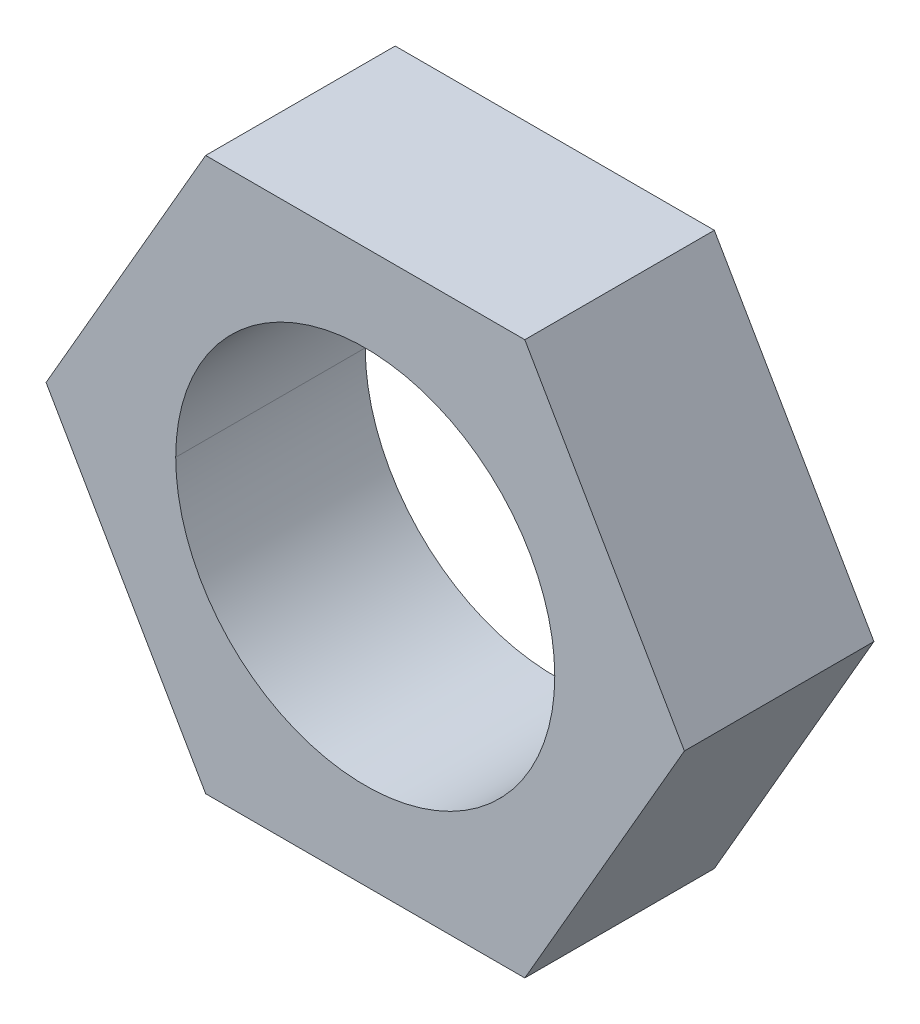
ISO-10303-21;
HEADER;
FILE_DESCRIPTION(('STEP AP214'),'2;1');
FILE_NAME('part.step','',(''),(''),'','','');
FILE_SCHEMA(('AUTOMOTIVE_DESIGN { 1 0 10303 214 1 1 1 1 }'));
ENDSEC;
DATA;
#1=APPLICATION_CONTEXT('core data for automotive mechanical design processes');
#2=APPLICATION_PROTOCOL_DEFINITION('international standard','automotive_design',2000,#1);
#3=PRODUCT_CONTEXT('',#1,'mechanical');
#4=PRODUCT('Part','Part','',(#3));
#5=PRODUCT_RELATED_PRODUCT_CATEGORY('part','',(#4));
#6=PRODUCT_DEFINITION_FORMATION('','',#4);
#7=PRODUCT_DEFINITION_CONTEXT('part definition',#1,'design');
#8=PRODUCT_DEFINITION('design','',#6,#7);
#9=PRODUCT_DEFINITION_SHAPE('','',#8);
#10=(LENGTH_UNIT() NAMED_UNIT(*) SI_UNIT(.MILLI.,.METRE.));
#11=(NAMED_UNIT(*) PLANE_ANGLE_UNIT() SI_UNIT($,.RADIAN.));
#12=(NAMED_UNIT(*) SI_UNIT($,.STERADIAN.) SOLID_ANGLE_UNIT());
#13=UNCERTAINTY_MEASURE_WITH_UNIT(LENGTH_MEASURE(1.E-05),#10,'distance_accuracy_value','');
#14=(GEOMETRIC_REPRESENTATION_CONTEXT(3) GLOBAL_UNCERTAINTY_ASSIGNED_CONTEXT((#13)) GLOBAL_UNIT_ASSIGNED_CONTEXT((#10,
#11,#12)) REPRESENTATION_CONTEXT('',''));
#15=CARTESIAN_POINT('',(0.,0.,0.));
#16=DIRECTION('',(0.,0.,1.));
#17=DIRECTION('',(1.,0.,0.));
#18=AXIS2_PLACEMENT_3D('',#15,#16,#17);
#19=CARTESIAN_POINT('',(-16.0395121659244,27.78125,9.525));
#20=DIRECTION('',(0.,0.,-1.));
#21=DIRECTION('',(-1.,0.,0.));
#22=AXIS2_PLACEMENT_3D('',#19,#20,#21);
#23=PLANE('',#22);
#24=DIRECTION('',(-0.500000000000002,-0.866025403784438,0.));
#25=VECTOR('',#24,1.);
#26=CARTESIAN_POINT('',(-32.0790243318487,0.,9.525));
#27=LINE('',#26,#25);
#28=CARTESIAN_POINT('',(-32.0790243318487,0.,9.525));
#29=VERTEX_POINT('',#28);
#30=CARTESIAN_POINT('',(-16.0395121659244,27.78125,9.525));
#31=VERTEX_POINT('',#30);
#32=EDGE_CURVE('E118',#29,#31,#27,.F.);
#33=ORIENTED_EDGE('',*,*,#32,.F.);
#34=DIRECTION('',(0.500000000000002,-0.866025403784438,0.));
#35=VECTOR('',#34,1.);
#36=CARTESIAN_POINT('',(-16.0395121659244,-27.78125,9.525));
#37=LINE('',#36,#35);
#38=CARTESIAN_POINT('',(-16.0395121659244,-27.78125,9.525));
#39=VERTEX_POINT('',#38);
#40=EDGE_CURVE('E161',#39,#29,#37,.F.);
#41=ORIENTED_EDGE('',*,*,#40,.F.);
#42=DIRECTION('',(1.,0.,0.));
#43=VECTOR('',#42,1.);
#44=CARTESIAN_POINT('',(16.0395121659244,-27.78125,9.525));
#45=LINE('',#44,#43);
#46=CARTESIAN_POINT('',(16.0395121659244,-27.78125,9.525));
#47=VERTEX_POINT('',#46);
#48=EDGE_CURVE('E154',#47,#39,#45,.F.);
#49=ORIENTED_EDGE('',*,*,#48,.F.);
#50=DIRECTION('',(0.500000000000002,0.866025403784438,0.));
#51=VECTOR('',#50,1.);
#52=CARTESIAN_POINT('',(32.0790243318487,0.,9.52500000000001));
#53=LINE('',#52,#51);
#54=CARTESIAN_POINT('',(32.0790243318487,0.,9.525));
#55=VERTEX_POINT('',#54);
#56=EDGE_CURVE('E146',#55,#47,#53,.F.);
#57=ORIENTED_EDGE('',*,*,#56,.F.);
#58=DIRECTION('',(-0.500000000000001,0.866025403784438,0.));
#59=VECTOR('',#58,1.);
#60=CARTESIAN_POINT('',(16.0395121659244,27.78125,9.525));
#61=LINE('',#60,#59);
#62=CARTESIAN_POINT('',(16.0395121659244,27.78125,9.525));
#63=VERTEX_POINT('',#62);
#64=EDGE_CURVE('E138',#63,#55,#61,.F.);
#65=ORIENTED_EDGE('',*,*,#64,.F.);
#66=DIRECTION('',(1.,0.,0.));
#67=VECTOR('',#66,1.);
#68=CARTESIAN_POINT('',(-16.0395121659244,27.78125,9.525));
#69=LINE('',#68,#67);
#70=EDGE_CURVE('E130',#31,#63,#69,.T.);
#71=ORIENTED_EDGE('',*,*,#70,.F.);
#72=EDGE_LOOP('',(#33,#41,#49,#57,#65,#71));
#73=FACE_BOUND('',#72,.T.);
#74=CARTESIAN_POINT('',(0.,1.83297821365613E-13,9.52500000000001));
#75=DIRECTION('',(0.,0.,1.));
#76=DIRECTION('',(1.,0.,0.));
#77=AXIS2_PLACEMENT_3D('',#74,#75,#76);
#78=CIRCLE('',#77,19.05);
#79=CARTESIAN_POINT('',(19.05,1.83297821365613E-13,9.52500000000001));
#80=VERTEX_POINT('',#79);
#81=CARTESIAN_POINT('',(-19.05,1.89860646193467E-13,9.52500000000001));
#82=VERTEX_POINT('',#81);
#83=EDGE_CURVE('E19',#80,#82,#78,.F.);
#84=ORIENTED_EDGE('',*,*,#83,.T.);
#85=CARTESIAN_POINT('',(0.,1.83297821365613E-13,9.52500000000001));
#86=DIRECTION('',(0.,0.,1.));
#87=DIRECTION('',(1.,0.,0.));
#88=AXIS2_PLACEMENT_3D('',#85,#86,#87);
#89=CIRCLE('',#88,19.05);
#90=EDGE_CURVE('E96',#82,#80,#89,.F.);
#91=ORIENTED_EDGE('',*,*,#90,.T.);
#92=EDGE_LOOP('',(#84,#91));
#93=FACE_BOUND('',#92,.T.);
#94=ADVANCED_FACE('F16',(#73,#93),#23,.F.);
#95=CARTESIAN_POINT('',(0.,1.83297821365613E-13,-248.116481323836));
#96=DIRECTION('',(0.,0.,1.));
#97=DIRECTION('',(1.,0.,0.));
#98=AXIS2_PLACEMENT_3D('',#95,#96,#97);
#99=CYLINDRICAL_SURFACE('',#98,19.05);
#100=CARTESIAN_POINT('',(0.,1.83297821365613E-13,-9.52500000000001));
#101=DIRECTION('',(0.,0.,1.));
#102=DIRECTION('',(1.,0.,0.));
#103=AXIS2_PLACEMENT_3D('',#100,#101,#102);
#104=CIRCLE('',#103,19.05);
#105=CARTESIAN_POINT('',(-19.05,1.89860646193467E-13,-9.52500000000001));
#106=VERTEX_POINT('',#105);
#107=CARTESIAN_POINT('',(19.05,1.83297821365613E-13,-9.52500000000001));
#108=VERTEX_POINT('',#107);
#109=EDGE_CURVE('E107',#106,#108,#104,.T.);
#110=ORIENTED_EDGE('',*,*,#109,.F.);
#111=DIRECTION('',(0.,0.,1.));
#112=VECTOR('',#111,1.);
#113=CARTESIAN_POINT('',(-19.05,3.20989087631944E-13,-248.116481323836));
#114=LINE('',#113,#112);
#115=EDGE_CURVE('E103',#106,#82,#114,.T.);
#116=ORIENTED_EDGE('',*,*,#115,.T.);
#117=ORIENTED_EDGE('',*,*,#83,.F.);
#118=DIRECTION('',(0.,0.,1.));
#119=VECTOR('',#118,1.);
#120=CARTESIAN_POINT('',(19.05,1.83297821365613E-13,-248.116481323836));
#121=LINE('',#120,#119);
#122=EDGE_CURVE('E114',#80,#108,#121,.F.);
#123=ORIENTED_EDGE('',*,*,#122,.T.);
#124=EDGE_LOOP('',(#110,#116,#117,#123));
#125=FACE_BOUND('',#124,.T.);
#126=ADVANCED_FACE('F105',(#125),#99,.F.);
#127=CARTESIAN_POINT('',(0.,1.83297821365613E-13,-248.116481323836));
#128=DIRECTION('',(0.,0.,1.));
#129=DIRECTION('',(1.,0.,0.));
#130=AXIS2_PLACEMENT_3D('',#127,#128,#129);
#131=CYLINDRICAL_SURFACE('',#130,19.05);
#132=ORIENTED_EDGE('',*,*,#90,.F.);
#133=ORIENTED_EDGE('',*,*,#115,.F.);
#134=CARTESIAN_POINT('',(0.,1.83297821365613E-13,-9.52500000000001));
#135=DIRECTION('',(0.,0.,1.));
#136=DIRECTION('',(1.,0.,0.));
#137=AXIS2_PLACEMENT_3D('',#134,#135,#136);
#138=CIRCLE('',#137,19.05);
#139=EDGE_CURVE('E123',#108,#106,#138,.T.);
#140=ORIENTED_EDGE('',*,*,#139,.F.);
#141=ORIENTED_EDGE('',*,*,#122,.F.);
#142=EDGE_LOOP('',(#132,#133,#140,#141));
#143=FACE_BOUND('',#142,.T.);
#144=ADVANCED_FACE('F113',(#143),#131,.F.);
#145=CARTESIAN_POINT('',(-32.0790243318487,0.,-9.525));
#146=DIRECTION('',(-0.866025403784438,0.500000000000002,0.));
#147=DIRECTION('',(-0.500000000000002,-0.866025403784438,0.));
#148=AXIS2_PLACEMENT_3D('',#145,#146,#147);
#149=PLANE('',#148);
#150=DIRECTION('',(0.500000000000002,0.866025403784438,0.));
#151=VECTOR('',#150,1.);
#152=CARTESIAN_POINT('',(-32.0790243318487,0.,-9.525));
#153=LINE('',#152,#151);
#154=CARTESIAN_POINT('',(-32.0790243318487,0.,-9.525));
#155=VERTEX_POINT('',#154);
#156=CARTESIAN_POINT('',(-16.0395121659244,27.78125,-9.525));
#157=VERTEX_POINT('',#156);
#158=EDGE_CURVE('E125',#155,#157,#153,.T.);
#159=ORIENTED_EDGE('',*,*,#158,.F.);
#160=DIRECTION('',(0.,0.,1.));
#161=VECTOR('',#160,1.);
#162=CARTESIAN_POINT('',(-32.0790243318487,0.,-9.525));
#163=LINE('',#162,#161);
#164=EDGE_CURVE('E165',#29,#155,#163,.F.);
#165=ORIENTED_EDGE('',*,*,#164,.F.);
#166=ORIENTED_EDGE('',*,*,#32,.T.);
#167=DIRECTION('',(0.,0.,1.));
#168=VECTOR('',#167,1.);
#169=CARTESIAN_POINT('',(-16.0395121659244,27.78125,-9.525));
#170=LINE('',#169,#168);
#171=EDGE_CURVE('E134',#157,#31,#170,.T.);
#172=ORIENTED_EDGE('',*,*,#171,.F.);
#173=EDGE_LOOP('',(#159,#165,#166,#172));
#174=FACE_BOUND('',#173,.T.);
#175=ADVANCED_FACE('F204',(#174),#149,.T.);
#176=CARTESIAN_POINT('',(-16.0395121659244,27.78125,-9.525));
#177=DIRECTION('',(0.,1.,0.));
#178=DIRECTION('',(0.,0.,1.));
#179=AXIS2_PLACEMENT_3D('',#176,#177,#178);
#180=PLANE('',#179);
#181=DIRECTION('',(-1.,0.,0.));
#182=VECTOR('',#181,1.);
#183=CARTESIAN_POINT('',(0.,27.78125,-9.525));
#184=LINE('',#183,#182);
#185=CARTESIAN_POINT('',(16.0395121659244,27.78125,-9.525));
#186=VERTEX_POINT('',#185);
#187=EDGE_CURVE('E174',#157,#186,#184,.F.);
#188=ORIENTED_EDGE('',*,*,#187,.F.);
#189=ORIENTED_EDGE('',*,*,#171,.T.);
#190=ORIENTED_EDGE('',*,*,#70,.T.);
#191=DIRECTION('',(0.,0.,1.));
#192=VECTOR('',#191,1.);
#193=CARTESIAN_POINT('',(16.0395121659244,27.78125,-9.525));
#194=LINE('',#193,#192);
#195=EDGE_CURVE('E142',#186,#63,#194,.T.);
#196=ORIENTED_EDGE('',*,*,#195,.F.);
#197=EDGE_LOOP('',(#188,#189,#190,#196));
#198=FACE_BOUND('',#197,.T.);
#199=ADVANCED_FACE('F201',(#198),#180,.T.);
#200=CARTESIAN_POINT('',(16.0395121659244,27.78125,-9.525));
#201=DIRECTION('',(0.866025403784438,0.500000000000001,0.));
#202=DIRECTION('',(-0.500000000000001,0.866025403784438,0.));
#203=AXIS2_PLACEMENT_3D('',#200,#201,#202);
#204=PLANE('',#203);
#205=DIRECTION('',(0.500000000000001,-0.866025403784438,0.));
#206=VECTOR('',#205,1.);
#207=CARTESIAN_POINT('',(16.0395121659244,27.78125,-9.525));
#208=LINE('',#207,#206);
#209=CARTESIAN_POINT('',(32.0790243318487,0.,-9.525));
#210=VERTEX_POINT('',#209);
#211=EDGE_CURVE('E178',#186,#210,#208,.T.);
#212=ORIENTED_EDGE('',*,*,#211,.F.);
#213=ORIENTED_EDGE('',*,*,#195,.T.);
#214=ORIENTED_EDGE('',*,*,#64,.T.);
#215=DIRECTION('',(0.,0.,1.));
#216=VECTOR('',#215,1.);
#217=CARTESIAN_POINT('',(32.0790243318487,0.,-9.525));
#218=LINE('',#217,#216);
#219=EDGE_CURVE('E150',#210,#55,#218,.T.);
#220=ORIENTED_EDGE('',*,*,#219,.F.);
#221=EDGE_LOOP('',(#212,#213,#214,#220));
#222=FACE_BOUND('',#221,.T.);
#223=ADVANCED_FACE('F198',(#222),#204,.T.);
#224=CARTESIAN_POINT('',(32.0790243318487,0.,-9.525));
#225=DIRECTION('',(0.866025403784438,-0.500000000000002,0.));
#226=DIRECTION('',(0.500000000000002,0.866025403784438,0.));
#227=AXIS2_PLACEMENT_3D('',#224,#225,#226);
#228=PLANE('',#227);
#229=DIRECTION('',(-0.500000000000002,-0.866025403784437,0.));
#230=VECTOR('',#229,1.);
#231=CARTESIAN_POINT('',(32.0790243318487,0.,-9.525));
#232=LINE('',#231,#230);
#233=CARTESIAN_POINT('',(16.0395121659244,-27.78125,-9.525));
#234=VERTEX_POINT('',#233);
#235=EDGE_CURVE('E182',#210,#234,#232,.T.);
#236=ORIENTED_EDGE('',*,*,#235,.F.);
#237=ORIENTED_EDGE('',*,*,#219,.T.);
#238=ORIENTED_EDGE('',*,*,#56,.T.);
#239=DIRECTION('',(0.,0.,1.));
#240=VECTOR('',#239,1.);
#241=CARTESIAN_POINT('',(16.0395121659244,-27.78125,-9.525));
#242=LINE('',#241,#240);
#243=EDGE_CURVE('E157',#234,#47,#242,.T.);
#244=ORIENTED_EDGE('',*,*,#243,.F.);
#245=EDGE_LOOP('',(#236,#237,#238,#244));
#246=FACE_BOUND('',#245,.T.);
#247=ADVANCED_FACE('F194',(#246),#228,.T.);
#248=CARTESIAN_POINT('',(16.0395121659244,-27.78125,-9.525));
#249=DIRECTION('',(0.,-1.,0.));
#250=DIRECTION('',(1.,0.,0.));
#251=AXIS2_PLACEMENT_3D('',#248,#249,#250);
#252=PLANE('',#251);
#253=DIRECTION('',(-1.,0.,0.));
#254=VECTOR('',#253,1.);
#255=CARTESIAN_POINT('',(0.,-27.78125,-9.525));
#256=LINE('',#255,#254);
#257=CARTESIAN_POINT('',(-16.0395121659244,-27.78125,-9.525));
#258=VERTEX_POINT('',#257);
#259=EDGE_CURVE('E26',#234,#258,#256,.T.);
#260=ORIENTED_EDGE('',*,*,#259,.F.);
#261=ORIENTED_EDGE('',*,*,#243,.T.);
#262=ORIENTED_EDGE('',*,*,#48,.T.);
#263=DIRECTION('',(0.,0.,1.));
#264=VECTOR('',#263,1.);
#265=CARTESIAN_POINT('',(-16.0395121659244,-27.78125,-9.525));
#266=LINE('',#265,#264);
#267=EDGE_CURVE('E39',#258,#39,#266,.T.);
#268=ORIENTED_EDGE('',*,*,#267,.F.);
#269=EDGE_LOOP('',(#260,#261,#262,#268));
#270=FACE_BOUND('',#269,.T.);
#271=ADVANCED_FACE('F192',(#270),#252,.T.);
#272=CARTESIAN_POINT('',(-16.0395121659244,-27.78125,-9.525));
#273=DIRECTION('',(-0.866025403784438,-0.500000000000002,0.));
#274=DIRECTION('',(0.500000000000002,-0.866025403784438,0.));
#275=AXIS2_PLACEMENT_3D('',#272,#273,#274);
#276=PLANE('',#275);
#277=DIRECTION('',(-0.500000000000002,0.866025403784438,0.));
#278=VECTOR('',#277,1.);
#279=CARTESIAN_POINT('',(-16.0395121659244,-27.78125,-9.525));
#280=LINE('',#279,#278);
#281=EDGE_CURVE('E11',#258,#155,#280,.T.);
#282=ORIENTED_EDGE('',*,*,#281,.F.);
#283=ORIENTED_EDGE('',*,*,#267,.T.);
#284=ORIENTED_EDGE('',*,*,#40,.T.);
#285=ORIENTED_EDGE('',*,*,#164,.T.);
#286=EDGE_LOOP('',(#282,#283,#284,#285));
#287=FACE_BOUND('',#286,.T.);
#288=ADVANCED_FACE('F206',(#287),#276,.T.);
#289=CARTESIAN_POINT('',(0.,0.,-9.525));
#290=DIRECTION('',(0.,0.,-1.));
#291=DIRECTION('',(-1.,0.,0.));
#292=AXIS2_PLACEMENT_3D('',#289,#290,#291);
#293=PLANE('',#292);
#294=ORIENTED_EDGE('',*,*,#259,.T.);
#295=ORIENTED_EDGE('',*,*,#281,.T.);
#296=ORIENTED_EDGE('',*,*,#158,.T.);
#297=ORIENTED_EDGE('',*,*,#187,.T.);
#298=ORIENTED_EDGE('',*,*,#211,.T.);
#299=ORIENTED_EDGE('',*,*,#235,.T.);
#300=EDGE_LOOP('',(#294,#295,#296,#297,#298,#299));
#301=FACE_BOUND('',#300,.T.);
#302=ORIENTED_EDGE('',*,*,#109,.T.);
#303=ORIENTED_EDGE('',*,*,#139,.T.);
#304=EDGE_LOOP('',(#302,#303));
#305=FACE_BOUND('',#304,.T.);
#306=ADVANCED_FACE('F189',(#301,#305),#293,.T.);
#307=CLOSED_SHELL('',(#94,#126,#144,#175,#199,#223,#247,#271,#288,#306));
#308=MANIFOLD_SOLID_BREP('B1',#307);
#309=ADVANCED_BREP_SHAPE_REPRESENTATION('',(#18,#308),#14);
#310=SHAPE_DEFINITION_REPRESENTATION(#9,#309);
ENDSEC;
END-ISO-10303-21;
